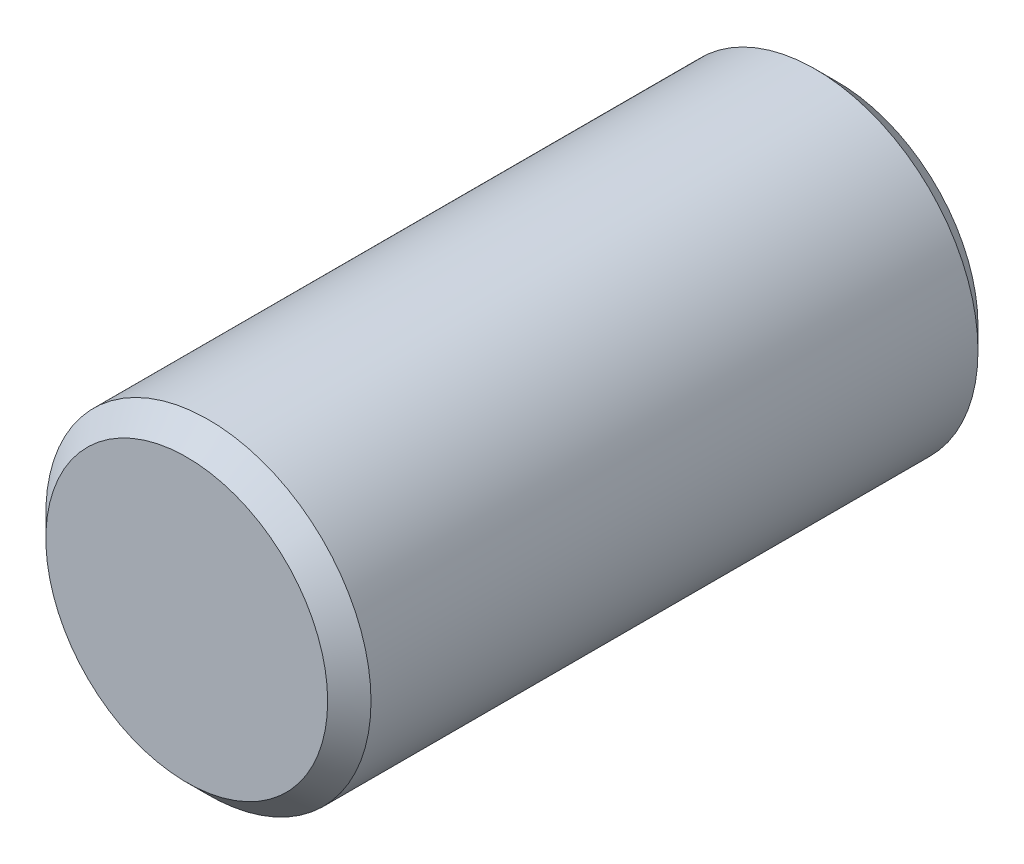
ISO-10303-21;
HEADER;
FILE_DESCRIPTION(('STEP AP214'),'2;1');
FILE_NAME('part.step','',(''),(''),'','','');
FILE_SCHEMA(('AUTOMOTIVE_DESIGN { 1 0 10303 214 1 1 1 1 }'));
ENDSEC;
DATA;
#1=APPLICATION_CONTEXT('core data for automotive mechanical design processes');
#2=APPLICATION_PROTOCOL_DEFINITION('international standard','automotive_design',2000,#1);
#3=PRODUCT_CONTEXT('',#1,'mechanical');
#4=PRODUCT('Part','Part','',(#3));
#5=PRODUCT_RELATED_PRODUCT_CATEGORY('part','',(#4));
#6=PRODUCT_DEFINITION_FORMATION('','',#4);
#7=PRODUCT_DEFINITION_CONTEXT('part definition',#1,'design');
#8=PRODUCT_DEFINITION('design','',#6,#7);
#9=PRODUCT_DEFINITION_SHAPE('','',#8);
#10=(LENGTH_UNIT() NAMED_UNIT(*) SI_UNIT(.MILLI.,.METRE.));
#11=(NAMED_UNIT(*) PLANE_ANGLE_UNIT() SI_UNIT($,.RADIAN.));
#12=(NAMED_UNIT(*) SI_UNIT($,.STERADIAN.) SOLID_ANGLE_UNIT());
#13=UNCERTAINTY_MEASURE_WITH_UNIT(LENGTH_MEASURE(1.E-05),#10,'distance_accuracy_value','');
#14=(GEOMETRIC_REPRESENTATION_CONTEXT(3) GLOBAL_UNCERTAINTY_ASSIGNED_CONTEXT((#13)) GLOBAL_UNIT_ASSIGNED_CONTEXT((#10,
#11,#12)) REPRESENTATION_CONTEXT('',''));
#15=CARTESIAN_POINT('',(0.,0.,0.));
#16=DIRECTION('',(0.,0.,1.));
#17=DIRECTION('',(1.,0.,0.));
#18=AXIS2_PLACEMENT_3D('',#15,#16,#17);
#19=CARTESIAN_POINT('',(0.,0.,6.));
#20=DIRECTION('',(0.,0.,-1.));
#21=DIRECTION('',(-1.,0.,0.));
#22=AXIS2_PLACEMENT_3D('',#19,#20,#21);
#23=CYLINDRICAL_SURFACE('',#22,1.5);
#24=CARTESIAN_POINT('',(0.,0.,0.2));
#25=DIRECTION('',(0.,0.,1.));
#26=DIRECTION('',(1.,0.,0.));
#27=AXIS2_PLACEMENT_3D('',#24,#25,#26);
#28=CIRCLE('',#27,1.5);
#29=CARTESIAN_POINT('',(1.5,0.,0.2));
#30=VERTEX_POINT('',#29);
#31=EDGE_CURVE('E43',#30,#30,#28,.T.);
#32=ORIENTED_EDGE('',*,*,#31,.T.);
#33=EDGE_LOOP('',(#32));
#34=FACE_BOUND('',#33,.T.);
#35=CARTESIAN_POINT('',(0.,0.,5.8));
#36=DIRECTION('',(0.,0.,1.));
#37=DIRECTION('',(1.,0.,0.));
#38=AXIS2_PLACEMENT_3D('',#35,#36,#37);
#39=CIRCLE('',#38,1.5);
#40=CARTESIAN_POINT('',(1.5,0.,5.8));
#41=VERTEX_POINT('',#40);
#42=EDGE_CURVE('E47',#41,#41,#39,.F.);
#43=ORIENTED_EDGE('',*,*,#42,.T.);
#44=EDGE_LOOP('',(#43));
#45=FACE_BOUND('',#44,.T.);
#46=ADVANCED_FACE('F33',(#34,#45),#23,.T.);
#47=CARTESIAN_POINT('',(0.,0.,6.));
#48=DIRECTION('',(0.,0.,1.));
#49=DIRECTION('',(1.,0.,0.));
#50=AXIS2_PLACEMENT_3D('',#47,#48,#49);
#51=PLANE('',#50);
#52=CARTESIAN_POINT('',(0.,0.,6.));
#53=DIRECTION('',(0.,0.,1.));
#54=DIRECTION('',(1.,0.,0.));
#55=AXIS2_PLACEMENT_3D('',#52,#53,#54);
#56=CIRCLE('',#55,1.3);
#57=CARTESIAN_POINT('',(1.3,0.,6.));
#58=VERTEX_POINT('',#57);
#59=EDGE_CURVE('E10',#58,#58,#56,.T.);
#60=ORIENTED_EDGE('',*,*,#59,.T.);
#61=EDGE_LOOP('',(#60));
#62=FACE_BOUND('',#61,.T.);
#63=ADVANCED_FACE('F66',(#62),#51,.T.);
#64=CARTESIAN_POINT('',(0.,0.,0.));
#65=DIRECTION('',(0.,0.,1.));
#66=DIRECTION('',(1.,0.,0.));
#67=AXIS2_PLACEMENT_3D('',#64,#65,#66);
#68=PLANE('',#67);
#69=CARTESIAN_POINT('',(0.,0.,0.));
#70=DIRECTION('',(0.,0.,1.));
#71=DIRECTION('',(1.,0.,0.));
#72=AXIS2_PLACEMENT_3D('',#69,#70,#71);
#73=CIRCLE('',#72,1.3);
#74=CARTESIAN_POINT('',(1.3,0.,0.));
#75=VERTEX_POINT('',#74);
#76=EDGE_CURVE('E39',#75,#75,#73,.F.);
#77=ORIENTED_EDGE('',*,*,#76,.T.);
#78=EDGE_LOOP('',(#77));
#79=FACE_BOUND('',#78,.T.);
#80=ADVANCED_FACE('F62',(#79),#68,.F.);
#81=CARTESIAN_POINT('',(0.,0.,0.2));
#82=DIRECTION('',(0.,0.,1.));
#83=DIRECTION('',(1.,0.,0.));
#84=AXIS2_PLACEMENT_3D('',#81,#82,#83);
#85=CONICAL_SURFACE('',#84,1.5,0.78539816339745);
#86=CARTESIAN_POINT('',(1.3,0.,0.));
#87=CARTESIAN_POINT('',(1.30208333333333,0.,0.0020833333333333));
#88=CARTESIAN_POINT('',(1.30416666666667,0.,0.00416666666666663));
#89=CARTESIAN_POINT('',(1.30833333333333,0.,0.00833333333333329));
#90=CARTESIAN_POINT('',(1.31041666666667,0.,0.0104166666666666));
#91=CARTESIAN_POINT('',(1.31458333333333,0.,0.0145833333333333));
#92=CARTESIAN_POINT('',(1.31666666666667,0.,0.0166666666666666));
#93=CARTESIAN_POINT('',(1.32083333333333,0.,0.0208333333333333));
#94=CARTESIAN_POINT('',(1.32291666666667,0.,0.0229166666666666));
#95=CARTESIAN_POINT('',(1.32708333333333,0.,0.0270833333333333));
#96=CARTESIAN_POINT('',(1.32916666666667,0.,0.0291666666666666));
#97=CARTESIAN_POINT('',(1.33333333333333,0.,0.0333333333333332));
#98=CARTESIAN_POINT('',(1.33541666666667,0.,0.0354166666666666));
#99=CARTESIAN_POINT('',(1.33958333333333,0.,0.0395833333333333));
#100=CARTESIAN_POINT('',(1.34166666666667,0.,0.0416666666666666));
#101=CARTESIAN_POINT('',(1.34583333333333,0.,0.0458333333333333));
#102=CARTESIAN_POINT('',(1.34791666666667,0.,0.0479166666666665));
#103=CARTESIAN_POINT('',(1.35208333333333,0.,0.0520833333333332));
#104=CARTESIAN_POINT('',(1.35416666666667,0.,0.0541666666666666));
#105=CARTESIAN_POINT('',(1.35833333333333,0.,0.0583333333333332));
#106=CARTESIAN_POINT('',(1.36041666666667,0.,0.0604166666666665));
#107=CARTESIAN_POINT('',(1.36458333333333,0.,0.0645833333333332));
#108=CARTESIAN_POINT('',(1.36666666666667,0.,0.0666666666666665));
#109=CARTESIAN_POINT('',(1.37083333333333,0.,0.0708333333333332));
#110=CARTESIAN_POINT('',(1.37291666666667,0.,0.0729166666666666));
#111=CARTESIAN_POINT('',(1.37708333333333,0.,0.0770833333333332));
#112=CARTESIAN_POINT('',(1.37916666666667,0.,0.0791666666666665));
#113=CARTESIAN_POINT('',(1.38333333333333,0.,0.0833333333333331));
#114=CARTESIAN_POINT('',(1.38541666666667,0.,0.0854166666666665));
#115=CARTESIAN_POINT('',(1.38958333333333,0.,0.0895833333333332));
#116=CARTESIAN_POINT('',(1.39166666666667,0.,0.0916666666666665));
#117=CARTESIAN_POINT('',(1.39583333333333,0.,0.0958333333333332));
#118=CARTESIAN_POINT('',(1.39791666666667,0.,0.0979166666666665));
#119=CARTESIAN_POINT('',(1.40208333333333,0.,0.102083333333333));
#120=CARTESIAN_POINT('',(1.40416666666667,0.,0.104166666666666));
#121=CARTESIAN_POINT('',(1.40833333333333,0.,0.108333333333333));
#122=CARTESIAN_POINT('',(1.41041666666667,0.,0.110416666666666));
#123=CARTESIAN_POINT('',(1.41458333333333,0.,0.114583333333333));
#124=CARTESIAN_POINT('',(1.41666666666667,0.,0.116666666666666));
#125=CARTESIAN_POINT('',(1.42083333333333,0.,0.120833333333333));
#126=CARTESIAN_POINT('',(1.42291666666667,0.,0.122916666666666));
#127=CARTESIAN_POINT('',(1.42708333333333,0.,0.127083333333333));
#128=CARTESIAN_POINT('',(1.42916666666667,0.,0.129166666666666));
#129=CARTESIAN_POINT('',(1.43333333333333,0.,0.133333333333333));
#130=CARTESIAN_POINT('',(1.43541666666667,0.,0.135416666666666));
#131=CARTESIAN_POINT('',(1.43958333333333,0.,0.139583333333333));
#132=CARTESIAN_POINT('',(1.44166666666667,0.,0.141666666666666));
#133=CARTESIAN_POINT('',(1.44583333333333,0.,0.145833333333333));
#134=CARTESIAN_POINT('',(1.44791666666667,0.,0.147916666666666));
#135=CARTESIAN_POINT('',(1.45208333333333,0.,0.152083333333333));
#136=CARTESIAN_POINT('',(1.45416666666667,0.,0.154166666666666));
#137=CARTESIAN_POINT('',(1.45833333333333,0.,0.158333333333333));
#138=CARTESIAN_POINT('',(1.46041666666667,0.,0.160416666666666));
#139=CARTESIAN_POINT('',(1.46458333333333,0.,0.164583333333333));
#140=CARTESIAN_POINT('',(1.46666666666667,0.,0.166666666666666));
#141=CARTESIAN_POINT('',(1.47083333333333,0.,0.170833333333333));
#142=CARTESIAN_POINT('',(1.47291666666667,0.,0.172916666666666));
#143=CARTESIAN_POINT('',(1.47708333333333,0.,0.177083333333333));
#144=CARTESIAN_POINT('',(1.47916666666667,0.,0.179166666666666));
#145=CARTESIAN_POINT('',(1.48333333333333,0.,0.183333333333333));
#146=CARTESIAN_POINT('',(1.48541666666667,0.,0.185416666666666));
#147=CARTESIAN_POINT('',(1.48958333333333,0.,0.189583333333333));
#148=CARTESIAN_POINT('',(1.49166666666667,0.,0.191666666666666));
#149=CARTESIAN_POINT('',(1.49583333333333,0.,0.195833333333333));
#150=CARTESIAN_POINT('',(1.49791666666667,0.,0.197916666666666));
#151=CARTESIAN_POINT('',(1.5,0.,0.2));
#152=B_SPLINE_CURVE_WITH_KNOTS('',3,(#86,#87,#88,#89,#90,#91,#92,#93,#94,#95,#96,#97,#98,#99,
#100,#101,#102,#103,#104,#105,#106,#107,#108,#109,#110,#111,#112,#113,#114,#115,#116,#117,#118,
#119,#120,#121,#122,#123,#124,#125,#126,#127,#128,#129,#130,#131,#132,#133,#134,#135,#136,#137,
#138,#139,#140,#141,#142,#143,#144,#145,#146,#147,#148,#149,#150,#151),.UNSPECIFIED.,.F.,.F.,(4,
2,2,2,2,2,2,2,2,2,2,2,2,2,2,2,2,2,2,2,2,2,2,2,2,2,2,2,2,2,2,2,4),(0.,0.00883883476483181,
0.0176776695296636,0.0265165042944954,0.0353553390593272,0.0441941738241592,0.053033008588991,
0.0618718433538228,0.0707106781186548,0.0795495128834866,0.0883883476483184,0.0972271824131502,
0.106066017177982,0.114904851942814,0.123743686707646,0.132582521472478,0.141421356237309,
0.150260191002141,0.159099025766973,0.167937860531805,0.176776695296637,0.185615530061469,
0.194454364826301,0.203293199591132,0.212132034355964,0.220970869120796,0.229809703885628,
0.23864853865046,0.247487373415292,0.256326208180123,0.265165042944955,0.274003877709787,
0.282842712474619),.UNSPECIFIED.);
#153=EDGE_CURVE('BSEAM57',#75,#30,#152,.T.);
#154=ORIENTED_EDGE('',*,*,#76,.F.);
#155=ORIENTED_EDGE('',*,*,#31,.F.);
#156=ORIENTED_EDGE('',*,*,#153,.T.);
#157=ORIENTED_EDGE('',*,*,#153,.F.);
#158=EDGE_LOOP('',(#154,#156,#155,#157));
#159=FACE_BOUND('',#158,.T.);
#160=ADVANCED_FACE('F57',(#159),#85,.T.);
#161=CARTESIAN_POINT('',(0.,0.,6.));
#162=DIRECTION('',(0.,0.,-1.));
#163=DIRECTION('',(-1.,0.,0.));
#164=AXIS2_PLACEMENT_3D('',#161,#162,#163);
#165=CONICAL_SURFACE('',#164,1.3,0.785398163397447);
#166=ORIENTED_EDGE('',*,*,#42,.F.);
#167=EDGE_LOOP('',(#166));
#168=FACE_BOUND('',#167,.T.);
#169=ORIENTED_EDGE('',*,*,#59,.F.);
#170=EDGE_LOOP('',(#169));
#171=FACE_BOUND('',#170,.T.);
#172=ADVANCED_FACE('F54',(#168,#171),#165,.T.);
#173=CLOSED_SHELL('',(#46,#63,#80,#160,#172));
#174=MANIFOLD_SOLID_BREP('B2',#173);
#175=ADVANCED_BREP_SHAPE_REPRESENTATION('',(#18,#174),#14);
#176=SHAPE_DEFINITION_REPRESENTATION(#9,#175);
ENDSEC;
END-ISO-10303-21;
